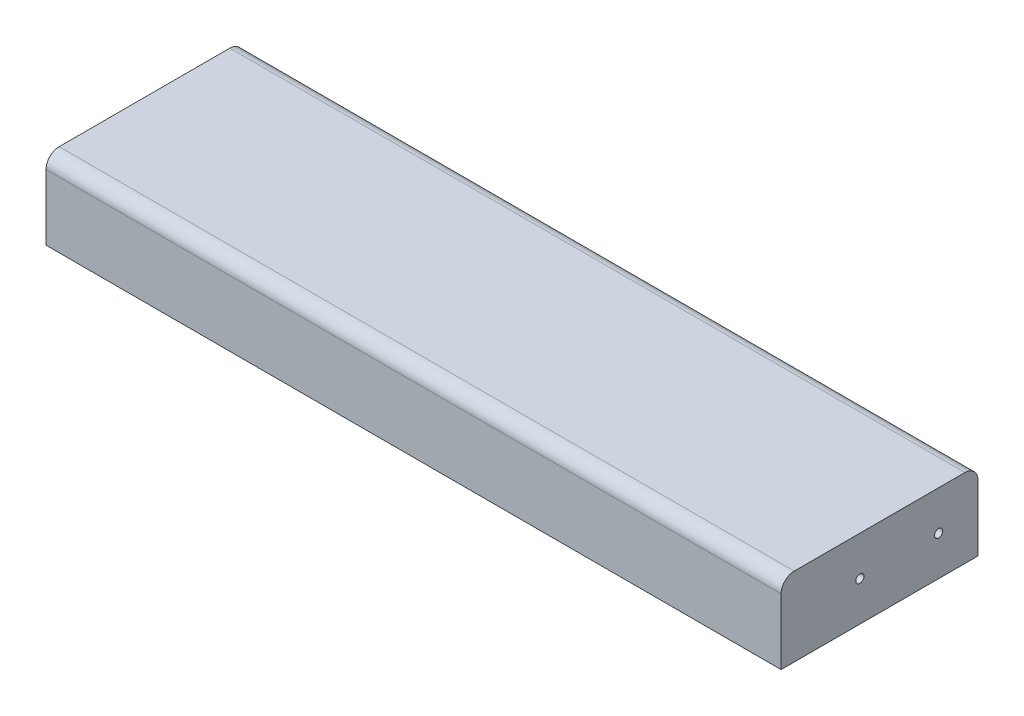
from build123d import *

# Parameters (mm, degrees)
SCHIZZO1_R                   = 1.55
ESTRUSIONE_ESTRUSIONE1_DEPTH = 280
SVUOTA1_T                    = -2


with BuildPart() as part:
    # Schizzo1 → Estrusione-Estrusione1 (new body)
    with BuildSketch(Plane(origin=(0, 0, 0), x_dir=(0, 0, -1), z_dir=(1, 0, 0))):
        with BuildLine():
            Line((-32.5, 30), (32.5, 30))
            ThreePointArc((32.5, 30), (36.035533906, 28.535533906), (37.5, 25))
            Line((37.5, 25), (37.5, 0))
            Line((37.5, 0), (-37.5, 0))
            Line((-37.5, 0), (-37.5, 25))
            ThreePointArc((-37.5, 25), (-36.035533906, 28.535533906), (-32.5, 30))
        make_face()
        with Locations((-7.5, 15)):
            Circle(SCHIZZO1_R, mode=Mode.SUBTRACT)
        with Locations((22.5, 15)):
            Circle(SCHIZZO1_R, mode=Mode.SUBTRACT)
    extrude(amount=ESTRUSIONE_ESTRUSIONE1_DEPTH)

    # Svuota1
    svuota1_openings = [part.faces().sort_by_distance(p)[0] for p in [
        (140, 0, 0),
    ]]
    offset(amount=SVUOTA1_T, openings=svuota1_openings, kind=Kind.INTERSECTION)


solid = part.part
